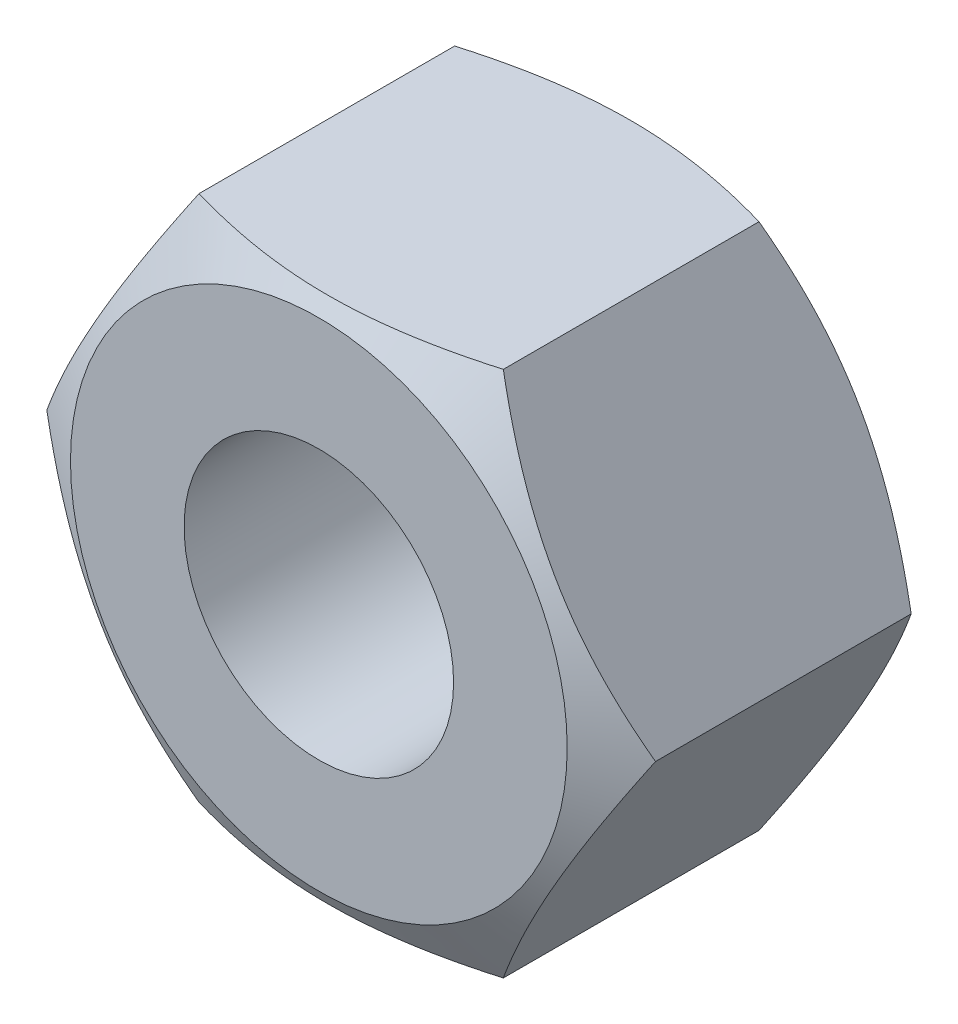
ISO-10303-21;
HEADER;
FILE_DESCRIPTION(('STEP AP214'),'2;1');
FILE_NAME('part.step','',(''),(''),'','','');
FILE_SCHEMA(('AUTOMOTIVE_DESIGN { 1 0 10303 214 1 1 1 1 }'));
ENDSEC;
DATA;
#1=APPLICATION_CONTEXT('core data for automotive mechanical design processes');
#2=APPLICATION_PROTOCOL_DEFINITION('international standard','automotive_design',2000,#1);
#3=PRODUCT_CONTEXT('',#1,'mechanical');
#4=PRODUCT('Part','Part','',(#3));
#5=PRODUCT_RELATED_PRODUCT_CATEGORY('part','',(#4));
#6=PRODUCT_DEFINITION_FORMATION('','',#4);
#7=PRODUCT_DEFINITION_CONTEXT('part definition',#1,'design');
#8=PRODUCT_DEFINITION('design','',#6,#7);
#9=PRODUCT_DEFINITION_SHAPE('','',#8);
#10=(LENGTH_UNIT() NAMED_UNIT(*) SI_UNIT(.MILLI.,.METRE.));
#11=(NAMED_UNIT(*) PLANE_ANGLE_UNIT() SI_UNIT($,.RADIAN.));
#12=(NAMED_UNIT(*) SI_UNIT($,.STERADIAN.) SOLID_ANGLE_UNIT());
#13=UNCERTAINTY_MEASURE_WITH_UNIT(LENGTH_MEASURE(1.E-05),#10,'distance_accuracy_value','');
#14=(GEOMETRIC_REPRESENTATION_CONTEXT(3) GLOBAL_UNCERTAINTY_ASSIGNED_CONTEXT((#13)) GLOBAL_UNIT_ASSIGNED_CONTEXT((#10,
#11,#12)) REPRESENTATION_CONTEXT('',''));
#15=CARTESIAN_POINT('',(0.,0.,0.));
#16=DIRECTION('',(0.,0.,1.));
#17=DIRECTION('',(1.,0.,0.));
#18=AXIS2_PLACEMENT_3D('',#15,#16,#17);
#19=CARTESIAN_POINT('',(-3.75277674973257,-6.49999999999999,-7.9));
#20=DIRECTION('',(0.,-1.,0.));
#21=DIRECTION('',(0.,0.,-1.));
#22=AXIS2_PLACEMENT_3D('',#19,#20,#21);
#23=PLANE('',#22);
#24=CARTESIAN_POINT('',(-9.92291866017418,-6.49999999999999,-3.31243543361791));
#25=CARTESIAN_POINT('',(-9.63776416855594,-6.49999999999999,-3.17475790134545));
#26=CARTESIAN_POINT('',(-9.35193207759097,-6.49999999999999,-3.0384582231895));
#27=CARTESIAN_POINT('',(-8.77854615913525,-6.49999999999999,-2.76940264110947));
#28=CARTESIAN_POINT('',(-8.49099204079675,-6.49999999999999,-2.63664735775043));
#29=CARTESIAN_POINT('',(-7.91222729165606,-6.49999999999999,-2.37476269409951));
#30=CARTESIAN_POINT('',(-7.62100513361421,-6.49999999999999,-2.24565869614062));
#31=CARTESIAN_POINT('',(-7.03615615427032,-6.49999999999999,-1.99303941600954));
#32=CARTESIAN_POINT('',(-6.74252946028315,-6.49999999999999,-1.86952384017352));
#33=CARTESIAN_POINT('',(-6.14889908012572,-6.49999999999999,-1.62815963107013));
#34=CARTESIAN_POINT('',(-5.84886102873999,-6.49999999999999,-1.51039504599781));
#35=CARTESIAN_POINT('',(-5.24523612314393,-6.49999999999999,-1.28416423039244));
#36=CARTESIAN_POINT('',(-4.94164887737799,-6.49999999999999,-1.17569903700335));
#37=CARTESIAN_POINT('',(-4.33107246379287,-6.49999999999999,-0.971003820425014));
#38=CARTESIAN_POINT('',(-4.02409220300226,-6.49999999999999,-0.874747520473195));
#39=CARTESIAN_POINT('',(-3.4057800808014,-6.49999999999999,-0.697613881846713));
#40=CARTESIAN_POINT('',(-3.09444963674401,-6.49999999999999,-0.61673165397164));
#41=CARTESIAN_POINT('',(-2.46716042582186,-6.49999999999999,-0.47429512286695));
#42=CARTESIAN_POINT('',(-2.15120008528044,-6.49999999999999,-0.412747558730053));
#43=CARTESIAN_POINT('',(-1.67450484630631,-6.49999999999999,-0.338026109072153));
#44=CARTESIAN_POINT('',(-1.51512759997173,-6.49999999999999,-0.316050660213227));
#45=CARTESIAN_POINT('',(-1.19563647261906,-6.49999999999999,-0.278399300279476));
#46=CARTESIAN_POINT('',(-1.03552266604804,-6.49999999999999,-0.262722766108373));
#47=CARTESIAN_POINT('',(-0.715772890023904,-6.49999999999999,-0.238089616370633));
#48=CARTESIAN_POINT('',(-0.556140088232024,-6.49999999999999,-0.22909204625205));
#49=CARTESIAN_POINT('',(-0.236637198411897,-6.49999999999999,-0.217863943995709));
#50=CARTESIAN_POINT('',(-0.0767671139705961,-6.49999999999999,-0.215633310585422));
#51=CARTESIAN_POINT('',(0.24287902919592,-6.49999999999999,-0.217992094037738));
#52=CARTESIAN_POINT('',(0.402655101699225,-6.49999999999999,-0.222579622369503));
#53=CARTESIAN_POINT('',(0.721875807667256,-6.49999999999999,-0.238461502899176));
#54=CARTESIAN_POINT('',(0.881320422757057,-6.49999999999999,-0.249756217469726));
#55=CARTESIAN_POINT('',(1.26861535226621,-6.49999999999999,-0.285103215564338));
#56=CARTESIAN_POINT('',(1.49616063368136,-6.49999999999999,-0.312563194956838));
#57=CARTESIAN_POINT('',(1.94944838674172,-6.49999999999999,-0.379607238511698));
#58=CARTESIAN_POINT('',(2.17519058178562,-6.49999999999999,-0.41919312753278));
#59=CARTESIAN_POINT('',(2.85011634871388,-6.49999999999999,-0.554151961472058));
#60=CARTESIAN_POINT('',(3.29611473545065,-6.49999999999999,-0.665635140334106));
#61=CARTESIAN_POINT('',(3.96319486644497,-6.49999999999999,-0.857611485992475));
#62=CARTESIAN_POINT('',(4.18776829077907,-6.49999999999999,-0.926658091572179));
#63=CARTESIAN_POINT('',(4.63474566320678,-6.49999999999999,-1.07157381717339));
#64=CARTESIAN_POINT('',(4.85714941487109,-6.49999999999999,-1.14744354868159));
#65=CARTESIAN_POINT('',(5.29867675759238,-6.49999999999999,-1.30438448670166));
#66=CARTESIAN_POINT('',(5.51781178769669,-6.49999999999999,-1.38542383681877));
#67=CARTESIAN_POINT('',(5.9542212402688,-6.49999999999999,-1.55215593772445));
#68=CARTESIAN_POINT('',(6.17149627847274,-6.49999999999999,-1.6378470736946));
#69=CARTESIAN_POINT('',(6.38798886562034,-6.49999999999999,-1.72542773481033));
#70=B_SPLINE_CURVE_WITH_KNOTS('',3,(#24,#25,#26,#27,#28,#29,#30,#31,#32,#33,#34,#35,#36,#37,#38,
#39,#40,#41,#42,#43,#44,#45,#46,#47,#48,#49,#50,#51,#52,#53,#54,#55,#56,#57,#58,#59,#60,#61,#62,
#63,#64,#65,#66,#67,#68,#69),.UNSPECIFIED.,.F.,.F.,(4,2,2,2,2,2,2,2,2,2,2,2,2,2,2,2,2,2,2,2,2,2,
4),(0.,0.949967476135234,1.90010019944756,2.85572275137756,3.81129502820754,4.77814082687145,
5.74509431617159,6.70993001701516,7.67445836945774,8.63932253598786,9.12187297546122,
9.60437566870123,10.0838947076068,10.5634065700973,11.0427856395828,11.5221906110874,
12.2093882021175,12.8966892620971,14.2739466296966,14.97873729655,15.6835911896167,
16.3844572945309,17.085081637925),.UNSPECIFIED.);
#71=CARTESIAN_POINT('',(-3.75277674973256,-6.50000000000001,-0.797062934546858));
#72=VERTEX_POINT('',#71);
#73=CARTESIAN_POINT('',(3.75277674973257,-6.49999999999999,-0.797062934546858));
#74=VERTEX_POINT('',#73);
#75=EDGE_CURVE('E47',#72,#74,#70,.T.);
#76=ORIENTED_EDGE('',*,*,#75,.F.);
#77=DIRECTION('',(0.,0.,1.));
#78=VECTOR('',#77,1.);
#79=CARTESIAN_POINT('',(-3.75277674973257,-6.49999999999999,-7.9));
#80=LINE('',#79,#78);
#81=CARTESIAN_POINT('',(-3.75277674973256,-6.50000000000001,-7.10293706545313));
#82=VERTEX_POINT('',#81);
#83=EDGE_CURVE('E11',#82,#72,#80,.T.);
#84=ORIENTED_EDGE('',*,*,#83,.F.);
#85=CARTESIAN_POINT('',(-9.92291866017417,-6.49999999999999,-4.58756456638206));
#86=CARTESIAN_POINT('',(-9.63776416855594,-6.49999999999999,-4.72524209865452));
#87=CARTESIAN_POINT('',(-9.35193207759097,-6.49999999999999,-4.86154177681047));
#88=CARTESIAN_POINT('',(-8.77854615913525,-6.49999999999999,-5.1305973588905));
#89=CARTESIAN_POINT('',(-8.49099204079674,-6.49999999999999,-5.26335264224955));
#90=CARTESIAN_POINT('',(-7.91222729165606,-6.49999999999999,-5.52523730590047));
#91=CARTESIAN_POINT('',(-7.62100513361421,-6.49999999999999,-5.65434130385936));
#92=CARTESIAN_POINT('',(-7.03615615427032,-6.49999999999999,-5.90696058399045));
#93=CARTESIAN_POINT('',(-6.74252946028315,-6.49999999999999,-6.03047615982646));
#94=CARTESIAN_POINT('',(-6.14889908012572,-6.49999999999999,-6.27184036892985));
#95=CARTESIAN_POINT('',(-5.84886102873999,-6.49999999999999,-6.38960495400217));
#96=CARTESIAN_POINT('',(-5.24523612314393,-6.49999999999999,-6.61583576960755));
#97=CARTESIAN_POINT('',(-4.94164887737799,-6.49999999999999,-6.72430096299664));
#98=CARTESIAN_POINT('',(-4.33107246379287,-6.49999999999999,-6.92899617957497));
#99=CARTESIAN_POINT('',(-4.02409220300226,-6.49999999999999,-7.02525247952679));
#100=CARTESIAN_POINT('',(-3.4057800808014,-6.49999999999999,-7.20238611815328));
#101=CARTESIAN_POINT('',(-3.09444963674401,-6.49999999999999,-7.28326834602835));
#102=CARTESIAN_POINT('',(-2.46716042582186,-6.49999999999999,-7.42570487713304));
#103=CARTESIAN_POINT('',(-2.15120008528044,-6.49999999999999,-7.48725244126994));
#104=CARTESIAN_POINT('',(-1.67450484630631,-6.49999999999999,-7.56197389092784));
#105=CARTESIAN_POINT('',(-1.51512759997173,-6.49999999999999,-7.58394933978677));
#106=CARTESIAN_POINT('',(-1.19563647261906,-6.49999999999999,-7.62160069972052));
#107=CARTESIAN_POINT('',(-1.03552266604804,-6.49999999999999,-7.63727723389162));
#108=CARTESIAN_POINT('',(-0.715772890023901,-6.49999999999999,-7.66191038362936));
#109=CARTESIAN_POINT('',(-0.556140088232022,-6.49999999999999,-7.67090795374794));
#110=CARTESIAN_POINT('',(-0.236637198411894,-6.49999999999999,-7.68213605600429));
#111=CARTESIAN_POINT('',(-0.0767671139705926,-6.49999999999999,-7.68436668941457));
#112=CARTESIAN_POINT('',(0.242879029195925,-6.49999999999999,-7.68200790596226));
#113=CARTESIAN_POINT('',(0.40265510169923,-6.49999999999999,-7.67742037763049));
#114=CARTESIAN_POINT('',(0.721875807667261,-6.49999999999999,-7.66153849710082));
#115=CARTESIAN_POINT('',(0.881320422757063,-6.49999999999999,-7.65024378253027));
#116=CARTESIAN_POINT('',(1.26861535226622,-6.49999999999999,-7.61489678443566));
#117=CARTESIAN_POINT('',(1.49616063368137,-6.49999999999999,-7.58743680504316));
#118=CARTESIAN_POINT('',(1.94944838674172,-6.49999999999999,-7.5203927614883));
#119=CARTESIAN_POINT('',(2.17519058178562,-6.49999999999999,-7.48080687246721));
#120=CARTESIAN_POINT('',(2.85011634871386,-6.49999999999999,-7.34584803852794));
#121=CARTESIAN_POINT('',(3.29611473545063,-6.49999999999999,-7.23436485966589));
#122=CARTESIAN_POINT('',(3.96319486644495,-6.49999999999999,-7.04238851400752));
#123=CARTESIAN_POINT('',(4.18776829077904,-6.49999999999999,-6.97334190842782));
#124=CARTESIAN_POINT('',(4.63474566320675,-6.49999999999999,-6.82842618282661));
#125=CARTESIAN_POINT('',(4.85714941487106,-6.49999999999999,-6.7525564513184));
#126=CARTESIAN_POINT('',(5.29867675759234,-6.49999999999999,-6.59561551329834));
#127=CARTESIAN_POINT('',(5.51781178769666,-6.49999999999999,-6.51457616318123));
#128=CARTESIAN_POINT('',(5.95422124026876,-6.49999999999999,-6.34784406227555));
#129=CARTESIAN_POINT('',(6.1714962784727,-6.49999999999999,-6.26215292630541));
#130=CARTESIAN_POINT('',(6.38798886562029,-6.49999999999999,-6.17457226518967));
#131=B_SPLINE_CURVE_WITH_KNOTS('',3,(#85,#86,#87,#88,#89,#90,#91,#92,#93,#94,#95,#96,#97,#98,
#99,#100,#101,#102,#103,#104,#105,#106,#107,#108,#109,#110,#111,#112,#113,#114,#115,#116,#117,
#118,#119,#120,#121,#122,#123,#124,#125,#126,#127,#128,#129,#130),.UNSPECIFIED.,.F.,.F.,(4,2,2,
2,2,2,2,2,2,2,2,2,2,2,2,2,2,2,2,2,2,2,4),(0.,0.949967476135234,1.90010019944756,
2.85572275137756,3.81129502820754,4.77814082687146,5.74509431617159,6.70993001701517,
7.67445836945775,8.63932253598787,9.12187297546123,9.60437566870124,10.0838947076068,
10.5634065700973,11.0427856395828,11.5221906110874,12.2093882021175,12.8966892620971,
14.2739466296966,14.97873729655,15.6835911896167,16.3844572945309,17.085081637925),.UNSPECIFIED.);
#132=CARTESIAN_POINT('',(3.75277674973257,-6.50000000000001,-7.10293706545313));
#133=VERTEX_POINT('',#132);
#134=EDGE_CURVE('E126',#133,#82,#131,.F.);
#135=ORIENTED_EDGE('',*,*,#134,.F.);
#136=DIRECTION('',(0.,0.,1.));
#137=VECTOR('',#136,1.);
#138=CARTESIAN_POINT('',(3.75277674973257,-6.49999999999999,-7.9));
#139=LINE('',#138,#137);
#140=EDGE_CURVE('E34',#133,#74,#139,.T.);
#141=ORIENTED_EDGE('',*,*,#140,.T.);
#142=EDGE_LOOP('',(#76,#84,#135,#141));
#143=FACE_BOUND('',#142,.T.);
#144=ADVANCED_FACE('F30',(#143),#23,.T.);
#145=CARTESIAN_POINT('',(-7.50555349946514,0.,-7.9));
#146=DIRECTION('',(-0.866025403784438,-0.500000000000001,0.));
#147=DIRECTION('',(0.500000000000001,-0.866025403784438,0.));
#148=AXIS2_PLACEMENT_3D('',#145,#146,#147);
#149=PLANE('',#148);
#150=CARTESIAN_POINT('',(-7.50566896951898,0.000200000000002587,-0.797129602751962));
#151=CARTESIAN_POINT('',(-7.4231786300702,-0.142677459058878,-0.749510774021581));
#152=CARTESIAN_POINT('',(-7.34038072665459,-0.28608763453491,-0.704053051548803));
#153=CARTESIAN_POINT('',(-7.17411251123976,-0.574072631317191,-0.618055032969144));
#154=CARTESIAN_POINT('',(-7.09064192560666,-0.718647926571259,-0.577516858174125));
#155=CARTESIAN_POINT('',(-6.83889369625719,-1.15468865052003,-0.46407735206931));
#156=CARTESIAN_POINT('',(-6.66962231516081,-1.44787528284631,-0.399554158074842));
#157=CARTESIAN_POINT('',(-6.41631077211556,-1.88662374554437,-0.323892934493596));
#158=CARTESIAN_POINT('',(-6.33302748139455,-2.03087463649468,-0.302339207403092));
#159=CARTESIAN_POINT('',(-6.16608458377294,-2.32002821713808,-0.266196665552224));
#160=CARTESIAN_POINT('',(-6.08242501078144,-2.46493084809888,-0.251607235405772));
#161=CARTESIAN_POINT('',(-5.91496056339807,-2.75498777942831,-0.229765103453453));
#162=CARTESIAN_POINT('',(-5.83115596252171,-2.9001416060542,-0.222504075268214));
#163=CARTESIAN_POINT('',(-5.66347396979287,-3.19057533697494,-0.215466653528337));
#164=CARTESIAN_POINT('',(-5.57959658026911,-3.33585523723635,-0.21569002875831));
#165=CARTESIAN_POINT('',(-5.34979921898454,-3.73387594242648,-0.22658980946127));
#166=CARTESIAN_POINT('',(-5.20395446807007,-3.98648646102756,-0.244888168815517));
#167=CARTESIAN_POINT('',(-4.91323365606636,-4.49002967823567,-0.302912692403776));
#168=CARTESIAN_POINT('',(-4.76835861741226,-4.74096060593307,-0.342658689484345));
#169=CARTESIAN_POINT('',(-4.47705272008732,-5.24551722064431,-0.442012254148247));
#170=CARTESIAN_POINT('',(-4.33065861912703,-5.4990792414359,-0.502040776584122));
#171=CARTESIAN_POINT('',(-4.04005357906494,-6.00242193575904,-0.63828134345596));
#172=CARTESIAN_POINT('',(-3.89583891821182,-6.25220905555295,-0.714461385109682));
#173=CARTESIAN_POINT('',(-3.75266127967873,-6.50019999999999,-0.797129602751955));
#174=B_SPLINE_CURVE_WITH_KNOTS('',3,(#150,#151,#152,#153,#154,#155,#156,#157,#158,#159,#160,
#161,#162,#163,#164,#165,#166,#167,#168,#169,#170,#171,#172,#173),.UNSPECIFIED.,.F.,.F.,(4,2,2,
2,2,2,2,2,2,2,2,4),(0.,0.515105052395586,1.03043143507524,2.06322554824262,2.56697389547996,
3.07067772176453,3.57380860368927,4.07692394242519,4.95279354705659,5.82947446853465,
6.72559912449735,7.61996451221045),.UNSPECIFIED.);
#175=CARTESIAN_POINT('',(-7.50555349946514,0.,-0.797062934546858));
#176=VERTEX_POINT('',#175);
#177=EDGE_CURVE('E87',#176,#72,#174,.T.);
#178=ORIENTED_EDGE('',*,*,#177,.F.);
#179=DIRECTION('',(0.,0.,1.));
#180=VECTOR('',#179,1.);
#181=CARTESIAN_POINT('',(-7.50555349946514,0.,-7.9));
#182=LINE('',#181,#180);
#183=CARTESIAN_POINT('',(-7.50555349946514,0.,-7.10293706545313));
#184=VERTEX_POINT('',#183);
#185=EDGE_CURVE('E39',#184,#176,#182,.T.);
#186=ORIENTED_EDGE('',*,*,#185,.F.);
#187=CARTESIAN_POINT('',(-3.75266127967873,-6.50019999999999,-7.10287039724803));
#188=CARTESIAN_POINT('',(-3.83515161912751,-6.35732254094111,-7.15048922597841));
#189=CARTESIAN_POINT('',(-3.91794952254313,-6.21391236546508,-7.19594694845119));
#190=CARTESIAN_POINT('',(-4.08421773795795,-5.9259273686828,-7.28194496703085));
#191=CARTESIAN_POINT('',(-4.16768832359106,-5.78135207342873,-7.32248314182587));
#192=CARTESIAN_POINT('',(-4.41943655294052,-5.34531134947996,-7.43592264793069));
#193=CARTESIAN_POINT('',(-4.5887079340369,-5.05212471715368,-7.50044584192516));
#194=CARTESIAN_POINT('',(-4.84201947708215,-4.61337625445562,-7.5761070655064));
#195=CARTESIAN_POINT('',(-4.92530276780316,-4.46912536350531,-7.5976607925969));
#196=CARTESIAN_POINT('',(-5.09224566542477,-4.17997178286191,-7.63380333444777));
#197=CARTESIAN_POINT('',(-5.17590523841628,-4.03506915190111,-7.64839276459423));
#198=CARTESIAN_POINT('',(-5.34336968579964,-3.74501222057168,-7.67023489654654));
#199=CARTESIAN_POINT('',(-5.427174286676,-3.59985839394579,-7.67749592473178));
#200=CARTESIAN_POINT('',(-5.59485627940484,-3.30942466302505,-7.68453334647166));
#201=CARTESIAN_POINT('',(-5.6787336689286,-3.16414476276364,-7.68430997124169));
#202=CARTESIAN_POINT('',(-5.90853103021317,-2.76612405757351,-7.67341019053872));
#203=CARTESIAN_POINT('',(-6.05437578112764,-2.51351353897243,-7.65511183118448));
#204=CARTESIAN_POINT('',(-6.34509659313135,-2.00997032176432,-7.59708730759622));
#205=CARTESIAN_POINT('',(-6.48997163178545,-1.75903939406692,-7.55734131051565));
#206=CARTESIAN_POINT('',(-6.78127752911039,-1.25448277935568,-7.45798774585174));
#207=CARTESIAN_POINT('',(-6.92767163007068,-1.00092075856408,-7.39795922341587));
#208=CARTESIAN_POINT('',(-7.21827667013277,-0.497578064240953,-7.26171865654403));
#209=CARTESIAN_POINT('',(-7.36249133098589,-0.247790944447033,-7.1855386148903));
#210=CARTESIAN_POINT('',(-7.50566896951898,0.00020000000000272,-7.10287039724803));
#211=B_SPLINE_CURVE_WITH_KNOTS('',3,(#187,#188,#189,#190,#191,#192,#193,#194,#195,#196,#197,
#198,#199,#200,#201,#202,#203,#204,#205,#206,#207,#208,#209,#210),.UNSPECIFIED.,.F.,.F.,(4,2,2,
2,2,2,2,2,2,2,2,4),(0.,0.515105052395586,1.03043143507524,2.06322554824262,2.56697389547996,
3.07067772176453,3.57380860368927,4.07692394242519,4.95279354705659,5.82947446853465,
6.72559912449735,7.61996451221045),.UNSPECIFIED.);
#212=EDGE_CURVE('E133',#82,#184,#211,.T.);
#213=ORIENTED_EDGE('',*,*,#212,.F.);
#214=ORIENTED_EDGE('',*,*,#83,.T.);
#215=EDGE_LOOP('',(#178,#186,#213,#214));
#216=FACE_BOUND('',#215,.T.);
#217=ADVANCED_FACE('F97',(#216),#149,.T.);
#218=CARTESIAN_POINT('',(-3.75277674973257,6.50000000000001,-7.9));
#219=DIRECTION('',(-0.866025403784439,0.5,0.));
#220=DIRECTION('',(-0.5,-0.866025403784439,0.));
#221=AXIS2_PLACEMENT_3D('',#218,#219,#220);
#222=PLANE('',#221);
#223=CARTESIAN_POINT('',(-3.75266127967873,6.50020000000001,-0.797129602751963));
#224=CARTESIAN_POINT('',(-3.83515161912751,6.35732254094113,-0.749510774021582));
#225=CARTESIAN_POINT('',(-3.91794952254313,6.21391236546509,-0.704053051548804));
#226=CARTESIAN_POINT('',(-4.08421773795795,5.92592736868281,-0.618055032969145));
#227=CARTESIAN_POINT('',(-4.16768832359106,5.78135207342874,-0.577516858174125));
#228=CARTESIAN_POINT('',(-4.41943655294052,5.34531134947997,-0.464077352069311));
#229=CARTESIAN_POINT('',(-4.5887079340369,5.05212471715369,-0.399554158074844));
#230=CARTESIAN_POINT('',(-4.84201947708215,4.61337625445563,-0.323892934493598));
#231=CARTESIAN_POINT('',(-4.92530276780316,4.46912536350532,-0.302339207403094));
#232=CARTESIAN_POINT('',(-5.09224566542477,4.17997178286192,-0.266196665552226));
#233=CARTESIAN_POINT('',(-5.17590523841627,4.03506915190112,-0.251607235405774));
#234=CARTESIAN_POINT('',(-5.34336968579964,3.74501222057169,-0.229765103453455));
#235=CARTESIAN_POINT('',(-5.427174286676,3.5998583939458,-0.222504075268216));
#236=CARTESIAN_POINT('',(-5.59485627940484,3.30942466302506,-0.215466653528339));
#237=CARTESIAN_POINT('',(-5.6787336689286,3.16414476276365,-0.215690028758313));
#238=CARTESIAN_POINT('',(-5.90853103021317,2.76612405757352,-0.226589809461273));
#239=CARTESIAN_POINT('',(-6.05437578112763,2.51351353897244,-0.24488816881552));
#240=CARTESIAN_POINT('',(-6.34509659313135,2.00997032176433,-0.30291269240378));
#241=CARTESIAN_POINT('',(-6.48997163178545,1.75903939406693,-0.342658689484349));
#242=CARTESIAN_POINT('',(-6.78127752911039,1.25448277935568,-0.442012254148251));
#243=CARTESIAN_POINT('',(-6.92767163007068,1.00092075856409,-0.502040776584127));
#244=CARTESIAN_POINT('',(-7.21827667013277,0.49757806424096,-0.638281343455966));
#245=CARTESIAN_POINT('',(-7.36249133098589,0.24779094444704,-0.714461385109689));
#246=CARTESIAN_POINT('',(-7.50566896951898,-0.000199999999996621,-0.797129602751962));
#247=B_SPLINE_CURVE_WITH_KNOTS('',3,(#223,#224,#225,#226,#227,#228,#229,#230,#231,#232,#233,
#234,#235,#236,#237,#238,#239,#240,#241,#242,#243,#244,#245,#246),.UNSPECIFIED.,.F.,.F.,(4,2,2,
2,2,2,2,2,2,2,2,4),(0.,0.515105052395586,1.03043143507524,2.06322554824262,2.56697389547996,
3.07067772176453,3.57380860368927,4.07692394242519,4.95279354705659,5.82947446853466,
6.72559912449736,7.61996451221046),.UNSPECIFIED.);
#248=CARTESIAN_POINT('',(-3.75277674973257,6.50000000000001,-0.797062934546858));
#249=VERTEX_POINT('',#248);
#250=EDGE_CURVE('E83',#249,#176,#247,.T.);
#251=ORIENTED_EDGE('',*,*,#250,.F.);
#252=DIRECTION('',(0.,0.,1.));
#253=VECTOR('',#252,1.);
#254=CARTESIAN_POINT('',(-3.75277674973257,6.50000000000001,-7.9));
#255=LINE('',#254,#253);
#256=CARTESIAN_POINT('',(-3.75277674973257,6.50000000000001,-7.10293706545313));
#257=VERTEX_POINT('',#256);
#258=EDGE_CURVE('E104',#257,#249,#255,.T.);
#259=ORIENTED_EDGE('',*,*,#258,.F.);
#260=CARTESIAN_POINT('',(-7.50566896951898,-0.000199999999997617,-7.10287039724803));
#261=CARTESIAN_POINT('',(-7.4231786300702,0.142677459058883,-7.15048922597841));
#262=CARTESIAN_POINT('',(-7.34038072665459,0.286087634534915,-7.19594694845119));
#263=CARTESIAN_POINT('',(-7.17411251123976,0.574072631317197,-7.28194496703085));
#264=CARTESIAN_POINT('',(-7.09064192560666,0.718647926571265,-7.32248314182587));
#265=CARTESIAN_POINT('',(-6.83889369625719,1.15468865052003,-7.43592264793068));
#266=CARTESIAN_POINT('',(-6.66962231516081,1.44787528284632,-7.50044584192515));
#267=CARTESIAN_POINT('',(-6.41631077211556,1.88662374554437,-7.5761070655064));
#268=CARTESIAN_POINT('',(-6.33302748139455,2.03087463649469,-7.5976607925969));
#269=CARTESIAN_POINT('',(-6.16608458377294,2.32002821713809,-7.63380333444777));
#270=CARTESIAN_POINT('',(-6.08242501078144,2.46493084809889,-7.64839276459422));
#271=CARTESIAN_POINT('',(-5.91496056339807,2.75498777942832,-7.67023489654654));
#272=CARTESIAN_POINT('',(-5.83115596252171,2.90014160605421,-7.67749592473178));
#273=CARTESIAN_POINT('',(-5.66347396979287,3.19057533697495,-7.68453334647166));
#274=CARTESIAN_POINT('',(-5.57959658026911,3.33585523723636,-7.68430997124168));
#275=CARTESIAN_POINT('',(-5.34979921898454,3.73387594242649,-7.67341019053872));
#276=CARTESIAN_POINT('',(-5.20395446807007,3.98648646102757,-7.65511183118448));
#277=CARTESIAN_POINT('',(-4.91323365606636,4.49002967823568,-7.59708730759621));
#278=CARTESIAN_POINT('',(-4.76835861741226,4.74096060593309,-7.55734131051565));
#279=CARTESIAN_POINT('',(-4.47705272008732,5.24551722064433,-7.45798774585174));
#280=CARTESIAN_POINT('',(-4.33065861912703,5.49907924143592,-7.39795922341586));
#281=CARTESIAN_POINT('',(-4.04005357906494,6.00242193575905,-7.26171865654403));
#282=CARTESIAN_POINT('',(-3.89583891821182,6.25220905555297,-7.1855386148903));
#283=CARTESIAN_POINT('',(-3.75266127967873,6.50020000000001,-7.10287039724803));
#284=B_SPLINE_CURVE_WITH_KNOTS('',3,(#260,#261,#262,#263,#264,#265,#266,#267,#268,#269,#270,
#271,#272,#273,#274,#275,#276,#277,#278,#279,#280,#281,#282,#283),.UNSPECIFIED.,.F.,.F.,(4,2,2,
2,2,2,2,2,2,2,2,4),(0.,0.515105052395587,1.03043143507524,2.06322554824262,2.56697389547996,
3.07067772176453,3.57380860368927,4.07692394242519,4.9527935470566,5.82947446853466,
6.72559912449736,7.61996451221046),.UNSPECIFIED.);
#285=EDGE_CURVE('E103',#184,#257,#284,.T.);
#286=ORIENTED_EDGE('',*,*,#285,.F.);
#287=ORIENTED_EDGE('',*,*,#185,.T.);
#288=EDGE_LOOP('',(#251,#259,#286,#287));
#289=FACE_BOUND('',#288,.T.);
#290=ADVANCED_FACE('F102',(#289),#222,.T.);
#291=CARTESIAN_POINT('',(3.75277674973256,6.50000000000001,-7.9));
#292=DIRECTION('',(0.,1.,0.));
#293=DIRECTION('',(0.,0.,1.));
#294=AXIS2_PLACEMENT_3D('',#291,#292,#293);
#295=PLANE('',#294);
#296=CARTESIAN_POINT('',(-9.92291866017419,6.50000000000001,-3.31243543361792));
#297=CARTESIAN_POINT('',(-9.63776416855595,6.50000000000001,-3.17475790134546));
#298=CARTESIAN_POINT('',(-9.35193207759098,6.50000000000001,-3.03845822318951));
#299=CARTESIAN_POINT('',(-8.77854615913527,6.50000000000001,-2.76940264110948));
#300=CARTESIAN_POINT('',(-8.49099204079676,6.50000000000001,-2.63664735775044));
#301=CARTESIAN_POINT('',(-7.91222729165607,6.50000000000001,-2.37476269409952));
#302=CARTESIAN_POINT('',(-7.62100513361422,6.50000000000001,-2.24565869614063));
#303=CARTESIAN_POINT('',(-7.03615615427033,6.50000000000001,-1.99303941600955));
#304=CARTESIAN_POINT('',(-6.74252946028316,6.50000000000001,-1.86952384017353));
#305=CARTESIAN_POINT('',(-6.14889908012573,6.50000000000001,-1.62815963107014));
#306=CARTESIAN_POINT('',(-5.84886102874,6.50000000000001,-1.51039504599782));
#307=CARTESIAN_POINT('',(-5.24523612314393,6.50000000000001,-1.28416423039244));
#308=CARTESIAN_POINT('',(-4.941648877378,6.50000000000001,-1.17569903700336));
#309=CARTESIAN_POINT('',(-4.33107246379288,6.50000000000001,-0.971003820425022));
#310=CARTESIAN_POINT('',(-4.02409220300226,6.50000000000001,-0.874747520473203));
#311=CARTESIAN_POINT('',(-3.4057800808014,6.50000000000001,-0.697613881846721));
#312=CARTESIAN_POINT('',(-3.09444963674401,6.50000000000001,-0.616731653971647));
#313=CARTESIAN_POINT('',(-2.46716042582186,6.50000000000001,-0.474295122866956));
#314=CARTESIAN_POINT('',(-2.15120008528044,6.50000000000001,-0.412747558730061));
#315=CARTESIAN_POINT('',(-1.6745048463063,6.50000000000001,-0.338026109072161));
#316=CARTESIAN_POINT('',(-1.51512759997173,6.50000000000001,-0.316050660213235));
#317=CARTESIAN_POINT('',(-1.19563647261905,6.50000000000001,-0.278399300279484));
#318=CARTESIAN_POINT('',(-1.03552266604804,6.50000000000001,-0.26272276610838));
#319=CARTESIAN_POINT('',(-0.715772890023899,6.50000000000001,-0.238089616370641));
#320=CARTESIAN_POINT('',(-0.55614008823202,6.50000000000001,-0.229092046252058));
#321=CARTESIAN_POINT('',(-0.236637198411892,6.50000000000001,-0.217863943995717));
#322=CARTESIAN_POINT('',(-0.0767671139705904,6.50000000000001,-0.21563331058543));
#323=CARTESIAN_POINT('',(0.242879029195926,6.50000000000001,-0.217992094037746));
#324=CARTESIAN_POINT('',(0.402655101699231,6.50000000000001,-0.222579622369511));
#325=CARTESIAN_POINT('',(0.721875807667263,6.50000000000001,-0.238461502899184));
#326=CARTESIAN_POINT('',(0.881320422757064,6.50000000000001,-0.249756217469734));
#327=CARTESIAN_POINT('',(1.26861535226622,6.50000000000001,-0.285103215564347));
#328=CARTESIAN_POINT('',(1.49616063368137,6.50000000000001,-0.312563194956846));
#329=CARTESIAN_POINT('',(1.94944838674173,6.50000000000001,-0.379607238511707));
#330=CARTESIAN_POINT('',(2.17519058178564,6.50000000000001,-0.41919312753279));
#331=CARTESIAN_POINT('',(2.85011634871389,6.50000000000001,-0.554151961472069));
#332=CARTESIAN_POINT('',(3.29611473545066,6.50000000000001,-0.665635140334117));
#333=CARTESIAN_POINT('',(3.96319486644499,6.50000000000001,-0.857611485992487));
#334=CARTESIAN_POINT('',(4.18776829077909,6.50000000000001,-0.926658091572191));
#335=CARTESIAN_POINT('',(4.6347456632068,6.50000000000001,-1.0715738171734));
#336=CARTESIAN_POINT('',(4.85714941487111,6.50000000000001,-1.14744354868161));
#337=CARTESIAN_POINT('',(5.2986767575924,6.50000000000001,-1.30438448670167));
#338=CARTESIAN_POINT('',(5.51781178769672,6.50000000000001,-1.38542383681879));
#339=CARTESIAN_POINT('',(5.95422124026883,6.50000000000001,-1.55215593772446));
#340=CARTESIAN_POINT('',(6.17149627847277,6.50000000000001,-1.63784707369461));
#341=CARTESIAN_POINT('',(6.38798886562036,6.50000000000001,-1.72542773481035));
#342=B_SPLINE_CURVE_WITH_KNOTS('',3,(#296,#297,#298,#299,#300,#301,#302,#303,#304,#305,#306,
#307,#308,#309,#310,#311,#312,#313,#314,#315,#316,#317,#318,#319,#320,#321,#322,#323,#324,#325,
#326,#327,#328,#329,#330,#331,#332,#333,#334,#335,#336,#337,#338,#339,#340,#341),.UNSPECIFIED.,
.F.,.F.,(4,2,2,2,2,2,2,2,2,2,2,2,2,2,2,2,2,2,2,2,2,2,4),(0.,0.949967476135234,1.90010019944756,
2.85572275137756,3.81129502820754,4.77814082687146,5.7450943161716,6.70993001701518,
7.67445836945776,8.63932253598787,9.12187297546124,9.60437566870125,10.0838947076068,
10.5634065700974,11.0427856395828,11.5221906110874,12.2093882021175,12.8966892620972,
14.2739466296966,14.97873729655,15.6835911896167,16.3844572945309,17.085081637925),.UNSPECIFIED.);
#343=CARTESIAN_POINT('',(3.75277674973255,6.50000000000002,-0.797062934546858));
#344=VERTEX_POINT('',#343);
#345=EDGE_CURVE('E89',#344,#249,#342,.F.);
#346=ORIENTED_EDGE('',*,*,#345,.F.);
#347=DIRECTION('',(0.,0.,1.));
#348=VECTOR('',#347,1.);
#349=CARTESIAN_POINT('',(3.75277674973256,6.50000000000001,-7.9));
#350=LINE('',#349,#348);
#351=CARTESIAN_POINT('',(3.75277674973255,6.50000000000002,-7.10293706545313));
#352=VERTEX_POINT('',#351);
#353=EDGE_CURVE('E106',#352,#344,#350,.T.);
#354=ORIENTED_EDGE('',*,*,#353,.F.);
#355=CARTESIAN_POINT('',(-9.92291866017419,6.50000000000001,-4.58756456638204));
#356=CARTESIAN_POINT('',(-9.63776416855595,6.50000000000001,-4.72524209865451));
#357=CARTESIAN_POINT('',(-9.35193207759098,6.50000000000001,-4.86154177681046));
#358=CARTESIAN_POINT('',(-8.77854615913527,6.50000000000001,-5.13059735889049));
#359=CARTESIAN_POINT('',(-8.49099204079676,6.50000000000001,-5.26335264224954));
#360=CARTESIAN_POINT('',(-7.91222729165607,6.50000000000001,-5.52523730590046));
#361=CARTESIAN_POINT('',(-7.62100513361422,6.50000000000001,-5.65434130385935));
#362=CARTESIAN_POINT('',(-7.03615615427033,6.50000000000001,-5.90696058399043));
#363=CARTESIAN_POINT('',(-6.74252946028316,6.50000000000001,-6.03047615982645));
#364=CARTESIAN_POINT('',(-6.14889908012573,6.50000000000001,-6.27184036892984));
#365=CARTESIAN_POINT('',(-5.84886102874,6.50000000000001,-6.38960495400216));
#366=CARTESIAN_POINT('',(-5.24523612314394,6.50000000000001,-6.61583576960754));
#367=CARTESIAN_POINT('',(-4.941648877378,6.50000000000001,-6.72430096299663));
#368=CARTESIAN_POINT('',(-4.33107246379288,6.50000000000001,-6.92899617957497));
#369=CARTESIAN_POINT('',(-4.02409220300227,6.50000000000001,-7.02525247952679));
#370=CARTESIAN_POINT('',(-3.4057800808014,6.50000000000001,-7.20238611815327));
#371=CARTESIAN_POINT('',(-3.09444963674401,6.50000000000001,-7.28326834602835));
#372=CARTESIAN_POINT('',(-2.46716042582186,6.50000000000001,-7.42570487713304));
#373=CARTESIAN_POINT('',(-2.15120008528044,6.50000000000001,-7.48725244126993));
#374=CARTESIAN_POINT('',(-1.6745048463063,6.50000000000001,-7.56197389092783));
#375=CARTESIAN_POINT('',(-1.51512759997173,6.50000000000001,-7.58394933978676));
#376=CARTESIAN_POINT('',(-1.19563647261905,6.50000000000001,-7.62160069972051));
#377=CARTESIAN_POINT('',(-1.03552266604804,6.50000000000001,-7.63727723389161));
#378=CARTESIAN_POINT('',(-0.715772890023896,6.50000000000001,-7.66191038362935));
#379=CARTESIAN_POINT('',(-0.556140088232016,6.50000000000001,-7.67090795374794));
#380=CARTESIAN_POINT('',(-0.236637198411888,6.50000000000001,-7.68213605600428));
#381=CARTESIAN_POINT('',(-0.0767671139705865,6.50000000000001,-7.68436668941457));
#382=CARTESIAN_POINT('',(0.242879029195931,6.50000000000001,-7.68200790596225));
#383=CARTESIAN_POINT('',(0.402655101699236,6.50000000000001,-7.67742037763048));
#384=CARTESIAN_POINT('',(0.721875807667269,6.50000000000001,-7.66153849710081));
#385=CARTESIAN_POINT('',(0.88132042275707,6.50000000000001,-7.65024378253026));
#386=CARTESIAN_POINT('',(1.26861535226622,6.50000000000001,-7.61489678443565));
#387=CARTESIAN_POINT('',(1.49616063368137,6.50000000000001,-7.58743680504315));
#388=CARTESIAN_POINT('',(1.94944838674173,6.50000000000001,-7.52039276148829));
#389=CARTESIAN_POINT('',(2.17519058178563,6.50000000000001,-7.4808068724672));
#390=CARTESIAN_POINT('',(2.85011634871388,6.50000000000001,-7.34584803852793));
#391=CARTESIAN_POINT('',(3.29611473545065,6.50000000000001,-7.23436485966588));
#392=CARTESIAN_POINT('',(3.96319486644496,6.50000000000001,-7.04238851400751));
#393=CARTESIAN_POINT('',(4.18776829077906,6.50000000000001,-6.97334190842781));
#394=CARTESIAN_POINT('',(4.63474566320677,6.50000000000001,-6.8284261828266));
#395=CARTESIAN_POINT('',(4.85714941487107,6.50000000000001,-6.75255645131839));
#396=CARTESIAN_POINT('',(5.29867675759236,6.50000000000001,-6.59561551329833));
#397=CARTESIAN_POINT('',(5.51781178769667,6.50000000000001,-6.51457616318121));
#398=CARTESIAN_POINT('',(5.95422124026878,6.50000000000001,-6.34784406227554));
#399=CARTESIAN_POINT('',(6.17149627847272,6.50000000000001,-6.26215292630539));
#400=CARTESIAN_POINT('',(6.38798886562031,6.50000000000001,-6.17457226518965));
#401=B_SPLINE_CURVE_WITH_KNOTS('',3,(#355,#356,#357,#358,#359,#360,#361,#362,#363,#364,#365,
#366,#367,#368,#369,#370,#371,#372,#373,#374,#375,#376,#377,#378,#379,#380,#381,#382,#383,#384,
#385,#386,#387,#388,#389,#390,#391,#392,#393,#394,#395,#396,#397,#398,#399,#400),.UNSPECIFIED.,
.F.,.F.,(4,2,2,2,2,2,2,2,2,2,2,2,2,2,2,2,2,2,2,2,2,2,4),(0.,0.949967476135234,1.90010019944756,
2.85572275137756,3.81129502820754,4.77814082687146,5.74509431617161,6.70993001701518,
7.67445836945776,8.63932253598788,9.12187297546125,9.60437566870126,10.0838947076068,
10.5634065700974,11.0427856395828,11.5221906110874,12.2093882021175,12.8966892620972,
14.2739466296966,14.97873729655,15.6835911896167,16.3844572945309,17.085081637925),.UNSPECIFIED.);
#402=EDGE_CURVE('E164',#257,#352,#401,.T.);
#403=ORIENTED_EDGE('',*,*,#402,.F.);
#404=ORIENTED_EDGE('',*,*,#258,.T.);
#405=EDGE_LOOP('',(#346,#354,#403,#404));
#406=FACE_BOUND('',#405,.T.);
#407=ADVANCED_FACE('F175',(#406),#295,.T.);
#408=CARTESIAN_POINT('',(7.50555349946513,0.,-7.9));
#409=DIRECTION('',(0.866025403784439,0.5,0.));
#410=DIRECTION('',(-0.5,0.866025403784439,0.));
#411=AXIS2_PLACEMENT_3D('',#408,#409,#410);
#412=PLANE('',#411);
#413=CARTESIAN_POINT('',(7.50566896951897,-0.000200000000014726,-0.797129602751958));
#414=CARTESIAN_POINT('',(7.4231786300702,0.142677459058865,-0.749510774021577));
#415=CARTESIAN_POINT('',(7.34038072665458,0.286087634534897,-0.704053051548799));
#416=CARTESIAN_POINT('',(7.17411251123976,0.574072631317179,-0.61805503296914));
#417=CARTESIAN_POINT('',(7.09064192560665,0.718647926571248,-0.57751685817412));
#418=CARTESIAN_POINT('',(6.83889369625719,1.15468865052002,-0.464077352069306));
#419=CARTESIAN_POINT('',(6.66962231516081,1.4478752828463,-0.399554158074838));
#420=CARTESIAN_POINT('',(6.41631077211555,1.88662374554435,-0.323892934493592));
#421=CARTESIAN_POINT('',(6.33302748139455,2.03087463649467,-0.302339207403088));
#422=CARTESIAN_POINT('',(6.16608458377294,2.32002821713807,-0.26619666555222));
#423=CARTESIAN_POINT('',(6.08242501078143,2.46493084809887,-0.251607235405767));
#424=CARTESIAN_POINT('',(5.91496056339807,2.7549877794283,-0.229765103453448));
#425=CARTESIAN_POINT('',(5.83115596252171,2.90014160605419,-0.222504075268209));
#426=CARTESIAN_POINT('',(5.66347396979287,3.19057533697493,-0.215466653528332));
#427=CARTESIAN_POINT('',(5.57959658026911,3.33585523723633,-0.215690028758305));
#428=CARTESIAN_POINT('',(5.34979921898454,3.73387594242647,-0.226589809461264));
#429=CARTESIAN_POINT('',(5.20395446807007,3.98648646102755,-0.244888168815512));
#430=CARTESIAN_POINT('',(4.91323365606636,4.49002967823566,-0.302912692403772));
#431=CARTESIAN_POINT('',(4.76835861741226,4.74096060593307,-0.342658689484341));
#432=CARTESIAN_POINT('',(4.47705272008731,5.24551722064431,-0.442012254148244));
#433=CARTESIAN_POINT('',(4.33065861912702,5.49907924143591,-0.50204077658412));
#434=CARTESIAN_POINT('',(4.04005357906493,6.00242193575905,-0.638281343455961));
#435=CARTESIAN_POINT('',(3.89583891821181,6.25220905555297,-0.714461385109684));
#436=CARTESIAN_POINT('',(3.75266127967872,6.50020000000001,-0.797129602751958));
#437=B_SPLINE_CURVE_WITH_KNOTS('',3,(#413,#414,#415,#416,#417,#418,#419,#420,#421,#422,#423,
#424,#425,#426,#427,#428,#429,#430,#431,#432,#433,#434,#435,#436),.UNSPECIFIED.,.F.,.F.,(4,2,2,
2,2,2,2,2,2,2,2,4),(0.,0.515105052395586,1.03043143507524,2.06322554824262,2.56697389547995,
3.07067772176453,3.57380860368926,4.07692394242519,4.9527935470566,5.82947446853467,
6.72559912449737,7.61996451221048),.UNSPECIFIED.);
#438=CARTESIAN_POINT('',(7.50555349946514,0.,-0.797062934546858));
#439=VERTEX_POINT('',#438);
#440=EDGE_CURVE('E206',#439,#344,#437,.T.);
#441=ORIENTED_EDGE('',*,*,#440,.F.);
#442=DIRECTION('',(0.,0.,1.));
#443=VECTOR('',#442,1.);
#444=CARTESIAN_POINT('',(7.50555349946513,0.,-7.9));
#445=LINE('',#444,#443);
#446=CARTESIAN_POINT('',(7.50555349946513,0.,-7.10293706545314));
#447=VERTEX_POINT('',#446);
#448=EDGE_CURVE('E111',#447,#439,#445,.T.);
#449=ORIENTED_EDGE('',*,*,#448,.F.);
#450=CARTESIAN_POINT('',(3.75266127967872,6.50020000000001,-7.10287039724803));
#451=CARTESIAN_POINT('',(3.83515161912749,6.35732254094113,-7.15048922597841));
#452=CARTESIAN_POINT('',(3.91794952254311,6.21391236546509,-7.19594694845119));
#453=CARTESIAN_POINT('',(4.08421773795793,5.92592736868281,-7.28194496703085));
#454=CARTESIAN_POINT('',(4.16768832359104,5.78135207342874,-7.32248314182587));
#455=CARTESIAN_POINT('',(4.4194365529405,5.34531134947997,-7.43592264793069));
#456=CARTESIAN_POINT('',(4.58870793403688,5.05212471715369,-7.50044584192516));
#457=CARTESIAN_POINT('',(4.84201947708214,4.61337625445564,-7.5761070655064));
#458=CARTESIAN_POINT('',(4.92530276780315,4.46912536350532,-7.59766079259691));
#459=CARTESIAN_POINT('',(5.09224566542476,4.17997178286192,-7.63380333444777));
#460=CARTESIAN_POINT('',(5.17590523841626,4.03506915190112,-7.64839276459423));
#461=CARTESIAN_POINT('',(5.34336968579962,3.74501222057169,-7.67023489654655));
#462=CARTESIAN_POINT('',(5.42717428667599,3.5998583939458,-7.67749592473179));
#463=CARTESIAN_POINT('',(5.59485627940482,3.30942466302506,-7.68453334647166));
#464=CARTESIAN_POINT('',(5.67873366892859,3.16414476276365,-7.68430997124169));
#465=CARTESIAN_POINT('',(5.90853103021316,2.76612405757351,-7.67341019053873));
#466=CARTESIAN_POINT('',(6.05437578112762,2.51351353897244,-7.65511183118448));
#467=CARTESIAN_POINT('',(6.34509659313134,2.00997032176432,-7.59708730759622));
#468=CARTESIAN_POINT('',(6.48997163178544,1.75903939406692,-7.55734131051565));
#469=CARTESIAN_POINT('',(6.78127752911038,1.25448277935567,-7.45798774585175));
#470=CARTESIAN_POINT('',(6.92767163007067,1.00092075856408,-7.39795922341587));
#471=CARTESIAN_POINT('',(7.21827667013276,0.497578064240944,-7.26171865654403));
#472=CARTESIAN_POINT('',(7.36249133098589,0.247790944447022,-7.18553861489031));
#473=CARTESIAN_POINT('',(7.50566896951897,-0.000200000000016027,-7.10287039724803));
#474=B_SPLINE_CURVE_WITH_KNOTS('',3,(#450,#451,#452,#453,#454,#455,#456,#457,#458,#459,#460,
#461,#462,#463,#464,#465,#466,#467,#468,#469,#470,#471,#472,#473),.UNSPECIFIED.,.F.,.F.,(4,2,2,
2,2,2,2,2,2,2,2,4),(0.,0.515105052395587,1.03043143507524,2.06322554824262,2.56697389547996,
3.07067772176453,3.57380860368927,4.07692394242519,4.9527935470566,5.82947446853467,
6.72559912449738,7.61996451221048),.UNSPECIFIED.);
#475=EDGE_CURVE('E55',#352,#447,#474,.T.);
#476=ORIENTED_EDGE('',*,*,#475,.F.);
#477=ORIENTED_EDGE('',*,*,#353,.T.);
#478=EDGE_LOOP('',(#441,#449,#476,#477));
#479=FACE_BOUND('',#478,.T.);
#480=ADVANCED_FACE('F205',(#479),#412,.T.);
#481=CARTESIAN_POINT('',(3.75277674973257,-6.49999999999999,-7.9));
#482=DIRECTION('',(0.866025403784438,-0.500000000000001,0.));
#483=DIRECTION('',(0.500000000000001,0.866025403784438,0.));
#484=AXIS2_PLACEMENT_3D('',#481,#482,#483);
#485=PLANE('',#484);
#486=CARTESIAN_POINT('',(3.75266127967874,-6.50019999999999,-0.797129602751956));
#487=CARTESIAN_POINT('',(3.83515161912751,-6.35732254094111,-0.749510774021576));
#488=CARTESIAN_POINT('',(3.91794952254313,-6.21391236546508,-0.704053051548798));
#489=CARTESIAN_POINT('',(4.08421773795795,-5.9259273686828,-0.61805503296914));
#490=CARTESIAN_POINT('',(4.16768832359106,-5.78135207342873,-0.57751685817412));
#491=CARTESIAN_POINT('',(4.41943655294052,-5.34531134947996,-0.464077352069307));
#492=CARTESIAN_POINT('',(4.5887079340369,-5.05212471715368,-0.39955415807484));
#493=CARTESIAN_POINT('',(4.84201947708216,-4.61337625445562,-0.323892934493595));
#494=CARTESIAN_POINT('',(4.92530276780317,-4.46912536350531,-0.302339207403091));
#495=CARTESIAN_POINT('',(5.09224566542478,-4.17997178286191,-0.266196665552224));
#496=CARTESIAN_POINT('',(5.17590523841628,-4.03506915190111,-0.251607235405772));
#497=CARTESIAN_POINT('',(5.34336968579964,-3.74501222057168,-0.229765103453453));
#498=CARTESIAN_POINT('',(5.427174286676,-3.59985839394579,-0.222504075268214));
#499=CARTESIAN_POINT('',(5.59485627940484,-3.30942466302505,-0.215466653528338));
#500=CARTESIAN_POINT('',(5.67873366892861,-3.16414476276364,-0.215690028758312));
#501=CARTESIAN_POINT('',(5.90853103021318,-2.76612405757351,-0.226589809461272));
#502=CARTESIAN_POINT('',(6.05437578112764,-2.51351353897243,-0.24488816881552));
#503=CARTESIAN_POINT('',(6.34509659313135,-2.00997032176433,-0.30291269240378));
#504=CARTESIAN_POINT('',(6.48997163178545,-1.75903939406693,-0.342658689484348));
#505=CARTESIAN_POINT('',(6.78127752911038,-1.25448277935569,-0.44201225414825));
#506=CARTESIAN_POINT('',(6.92767163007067,-1.0009207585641,-0.502040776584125));
#507=CARTESIAN_POINT('',(7.21827667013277,-0.497578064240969,-0.638281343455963));
#508=CARTESIAN_POINT('',(7.36249133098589,-0.247790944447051,-0.714461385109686));
#509=CARTESIAN_POINT('',(7.50566896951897,0.000199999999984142,-0.797129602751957));
#510=B_SPLINE_CURVE_WITH_KNOTS('',3,(#486,#487,#488,#489,#490,#491,#492,#493,#494,#495,#496,
#497,#498,#499,#500,#501,#502,#503,#504,#505,#506,#507,#508,#509),.UNSPECIFIED.,.F.,.F.,(4,2,2,
2,2,2,2,2,2,2,2,4),(0.,0.515105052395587,1.03043143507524,2.06322554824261,2.56697389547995,
3.07067772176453,3.57380860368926,4.07692394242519,4.95279354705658,5.82947446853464,
6.72559912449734,7.61996451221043),.UNSPECIFIED.);
#511=EDGE_CURVE('E207',#74,#439,#510,.T.);
#512=ORIENTED_EDGE('',*,*,#511,.F.);
#513=ORIENTED_EDGE('',*,*,#140,.F.);
#514=CARTESIAN_POINT('',(7.50566896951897,0.000199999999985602,-7.10287039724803));
#515=CARTESIAN_POINT('',(7.4231786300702,-0.142677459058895,-7.15048922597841));
#516=CARTESIAN_POINT('',(7.34038072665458,-0.286087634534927,-7.19594694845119));
#517=CARTESIAN_POINT('',(7.17411251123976,-0.574072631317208,-7.28194496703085));
#518=CARTESIAN_POINT('',(7.09064192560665,-0.718647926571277,-7.32248314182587));
#519=CARTESIAN_POINT('',(6.83889369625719,-1.15468865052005,-7.43592264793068));
#520=CARTESIAN_POINT('',(6.66962231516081,-1.44787528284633,-7.50044584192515));
#521=CARTESIAN_POINT('',(6.41631077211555,-1.88662374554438,-7.5761070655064));
#522=CARTESIAN_POINT('',(6.33302748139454,-2.0308746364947,-7.5976607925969));
#523=CARTESIAN_POINT('',(6.16608458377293,-2.3200282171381,-7.63380333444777));
#524=CARTESIAN_POINT('',(6.08242501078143,-2.4649308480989,-7.64839276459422));
#525=CARTESIAN_POINT('',(5.91496056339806,-2.75498777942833,-7.67023489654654));
#526=CARTESIAN_POINT('',(5.8311559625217,-2.90014160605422,-7.67749592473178));
#527=CARTESIAN_POINT('',(5.66347396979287,-3.19057533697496,-7.68453334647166));
#528=CARTESIAN_POINT('',(5.5795965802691,-3.33585523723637,-7.68430997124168));
#529=CARTESIAN_POINT('',(5.34979921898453,-3.7338759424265,-7.67341019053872));
#530=CARTESIAN_POINT('',(5.20395446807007,-3.98648646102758,-7.65511183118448));
#531=CARTESIAN_POINT('',(4.91323365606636,-4.49002967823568,-7.59708730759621));
#532=CARTESIAN_POINT('',(4.76835861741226,-4.74096060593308,-7.55734131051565));
#533=CARTESIAN_POINT('',(4.47705272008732,-5.24551722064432,-7.45798774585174));
#534=CARTESIAN_POINT('',(4.33065861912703,-5.49907924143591,-7.39795922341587));
#535=CARTESIAN_POINT('',(4.04005357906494,-6.00242193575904,-7.26171865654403));
#536=CARTESIAN_POINT('',(3.89583891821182,-6.25220905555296,-7.18553861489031));
#537=CARTESIAN_POINT('',(3.75266127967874,-6.50019999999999,-7.10287039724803));
#538=B_SPLINE_CURVE_WITH_KNOTS('',3,(#514,#515,#516,#517,#518,#519,#520,#521,#522,#523,#524,
#525,#526,#527,#528,#529,#530,#531,#532,#533,#534,#535,#536,#537),.UNSPECIFIED.,.F.,.F.,(4,2,2,
2,2,2,2,2,2,2,2,4),(0.,0.515105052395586,1.03043143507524,2.06322554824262,2.56697389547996,
3.07067772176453,3.57380860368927,4.07692394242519,4.95279354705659,5.82947446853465,
6.72559912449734,7.61996451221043),.UNSPECIFIED.);
#539=EDGE_CURVE('E150',#447,#133,#538,.T.);
#540=ORIENTED_EDGE('',*,*,#539,.F.);
#541=ORIENTED_EDGE('',*,*,#448,.T.);
#542=EDGE_LOOP('',(#512,#513,#540,#541));
#543=FACE_BOUND('',#542,.T.);
#544=ADVANCED_FACE('F219',(#543),#485,.T.);
#545=CARTESIAN_POINT('',(11.2583302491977,-6.49999999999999,-7.9));
#546=DIRECTION('',(0.,0.,1.));
#547=DIRECTION('',(1.,0.,0.));
#548=AXIS2_PLACEMENT_3D('',#545,#546,#547);
#549=PLANE('',#548);
#550=CARTESIAN_POINT('',(0.,0.,-7.9));
#551=DIRECTION('',(0.,0.,-1.));
#552=DIRECTION('',(-1.,0.,0.));
#553=AXIS2_PLACEMENT_3D('',#550,#551,#552);
#554=CIRCLE('',#553,6.125);
#555=CARTESIAN_POINT('',(-6.125,0.,-7.9));
#556=VERTEX_POINT('',#555);
#557=EDGE_CURVE('E195',#556,#556,#554,.T.);
#558=ORIENTED_EDGE('',*,*,#557,.T.);
#559=EDGE_LOOP('',(#558));
#560=FACE_BOUND('',#559,.T.);
#561=CARTESIAN_POINT('',(0.,0.,-7.9));
#562=DIRECTION('',(0.,0.,1.));
#563=DIRECTION('',(1.,0.,0.));
#564=AXIS2_PLACEMENT_3D('',#561,#562,#563);
#565=CIRCLE('',#564,3.3235);
#566=CARTESIAN_POINT('',(3.3235,0.,-7.9));
#567=VERTEX_POINT('',#566);
#568=EDGE_CURVE('E116',#567,#567,#565,.T.);
#569=ORIENTED_EDGE('',*,*,#568,.T.);
#570=EDGE_LOOP('',(#569));
#571=FACE_BOUND('',#570,.T.);
#572=ADVANCED_FACE('F223',(#560,#571),#549,.F.);
#573=CARTESIAN_POINT('',(11.2583302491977,-6.49999999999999,0.));
#574=DIRECTION('',(0.,0.,1.));
#575=DIRECTION('',(1.,0.,0.));
#576=AXIS2_PLACEMENT_3D('',#573,#574,#575);
#577=PLANE('',#576);
#578=CARTESIAN_POINT('',(0.,0.,0.));
#579=DIRECTION('',(0.,0.,-1.));
#580=DIRECTION('',(-1.,0.,0.));
#581=AXIS2_PLACEMENT_3D('',#578,#579,#580);
#582=CIRCLE('',#581,6.125);
#583=CARTESIAN_POINT('',(-6.125,0.,0.));
#584=VERTEX_POINT('',#583);
#585=EDGE_CURVE('E208',#584,#584,#582,.T.);
#586=ORIENTED_EDGE('',*,*,#585,.F.);
#587=EDGE_LOOP('',(#586));
#588=FACE_BOUND('',#587,.T.);
#589=CARTESIAN_POINT('',(0.,0.,0.));
#590=DIRECTION('',(0.,0.,1.));
#591=DIRECTION('',(1.,0.,0.));
#592=AXIS2_PLACEMENT_3D('',#589,#590,#591);
#593=CIRCLE('',#592,3.3235);
#594=CARTESIAN_POINT('',(3.3235,0.,0.));
#595=VERTEX_POINT('',#594);
#596=EDGE_CURVE('E121',#595,#595,#593,.T.);
#597=ORIENTED_EDGE('',*,*,#596,.F.);
#598=EDGE_LOOP('',(#597));
#599=FACE_BOUND('',#598,.T.);
#600=ADVANCED_FACE('F228',(#588,#599),#577,.T.);
#601=CARTESIAN_POINT('',(0.,0.,-7.9));
#602=DIRECTION('',(0.,0.,1.));
#603=DIRECTION('',(1.,0.,0.));
#604=AXIS2_PLACEMENT_3D('',#601,#602,#603);
#605=CYLINDRICAL_SURFACE('',#604,3.3235);
#606=ORIENTED_EDGE('',*,*,#568,.F.);
#607=EDGE_LOOP('',(#606));
#608=FACE_BOUND('',#607,.T.);
#609=ORIENTED_EDGE('',*,*,#596,.T.);
#610=EDGE_LOOP('',(#609));
#611=FACE_BOUND('',#610,.T.);
#612=ADVANCED_FACE('F144',(#608,#611),#605,.F.);
#613=CARTESIAN_POINT('',(0.,0.,-7.10293706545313));
#614=DIRECTION('',(0.,0.,1.));
#615=DIRECTION('',(1.,0.,0.));
#616=AXIS2_PLACEMENT_3D('',#613,#614,#615);
#617=CONICAL_SURFACE('',#616,7.50555349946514,1.04719755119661);
#618=ORIENTED_EDGE('',*,*,#134,.T.);
#619=ORIENTED_EDGE('',*,*,#212,.T.);
#620=ORIENTED_EDGE('',*,*,#285,.T.);
#621=ORIENTED_EDGE('',*,*,#402,.T.);
#622=ORIENTED_EDGE('',*,*,#475,.T.);
#623=ORIENTED_EDGE('',*,*,#539,.T.);
#624=EDGE_LOOP('',(#618,#619,#620,#621,#622,#623));
#625=FACE_BOUND('',#624,.T.);
#626=ORIENTED_EDGE('',*,*,#557,.F.);
#627=EDGE_LOOP('',(#626));
#628=FACE_BOUND('',#627,.T.);
#629=ADVANCED_FACE('F139',(#625,#628),#617,.T.);
#630=CARTESIAN_POINT('',(0.,0.,0.));
#631=DIRECTION('',(0.,0.,-1.));
#632=DIRECTION('',(-1.,0.,0.));
#633=AXIS2_PLACEMENT_3D('',#630,#631,#632);
#634=CONICAL_SURFACE('',#633,6.125,1.04719755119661);
#635=ORIENTED_EDGE('',*,*,#75,.T.);
#636=ORIENTED_EDGE('',*,*,#511,.T.);
#637=ORIENTED_EDGE('',*,*,#440,.T.);
#638=ORIENTED_EDGE('',*,*,#345,.T.);
#639=ORIENTED_EDGE('',*,*,#250,.T.);
#640=ORIENTED_EDGE('',*,*,#177,.T.);
#641=EDGE_LOOP('',(#635,#636,#637,#638,#639,#640));
#642=FACE_BOUND('',#641,.T.);
#643=ORIENTED_EDGE('',*,*,#585,.T.);
#644=EDGE_LOOP('',(#643));
#645=FACE_BOUND('',#644,.T.);
#646=ADVANCED_FACE('F85',(#642,#645),#634,.T.);
#647=CLOSED_SHELL('',(#144,#217,#290,#407,#480,#544,#572,#600,#612,#629,#646));
#648=MANIFOLD_SOLID_BREP('B2',#647);
#649=ADVANCED_BREP_SHAPE_REPRESENTATION('',(#18,#648),#14);
#650=SHAPE_DEFINITION_REPRESENTATION(#9,#649);
ENDSEC;
END-ISO-10303-21;
